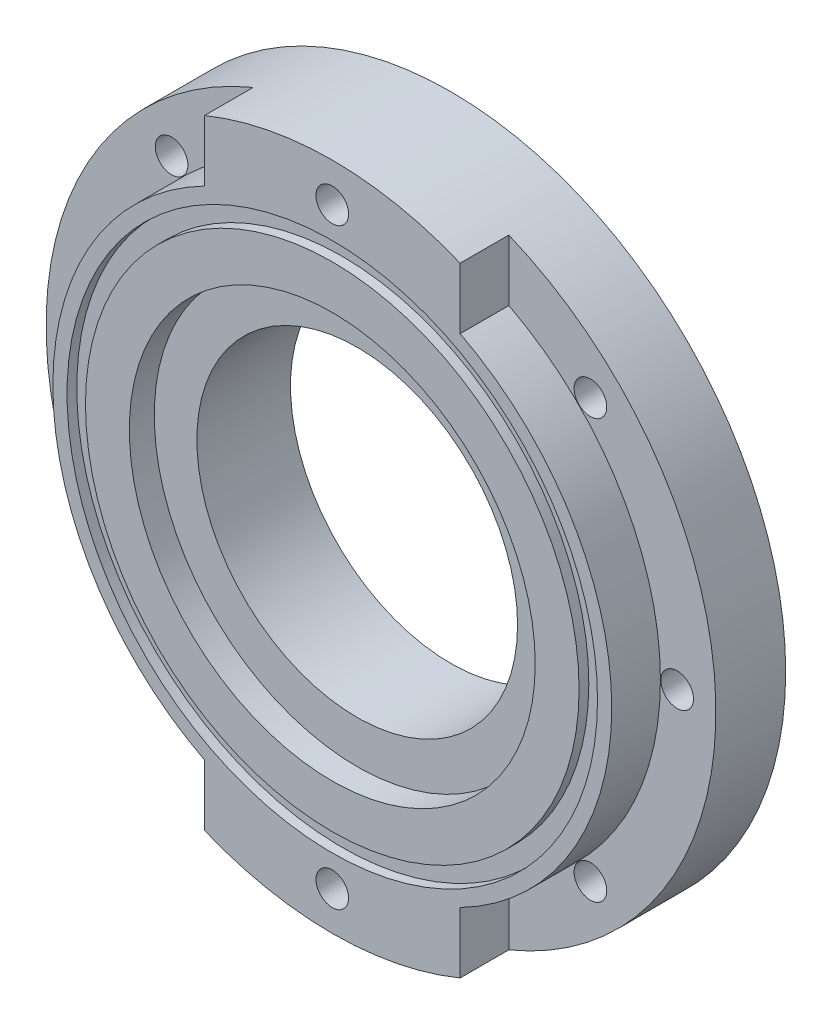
from build123d import *

# Parameters (mm, degrees)
SKETCH1_R           = 52.3875
SKETCH1_R_2         = 25.0825
BOSS_EXTRUDE1_DEPTH = 18.542
SKETCH4_R           = 41.4909
SKETCH4_R_2         = 38.608
CUT_EXTRUDE1_DEPTH  = 1.52146
CIRPATTERN1_COUNT   = 8
SKETCH11_R          = 31.75
CUT_EXTRUDE2_DEPTH  = 3.90144
CUT_EXTRUDE4_START  = -7.62
CUT_EXTRUDE4_DEPTH  = 7.62


with BuildPart() as part:
    # Sketch1 → Boss-Extrude1 (new body)
    with BuildSketch(Plane.XY):
        Circle(SKETCH1_R)
        Circle(SKETCH1_R_2, mode=Mode.SUBTRACT)
    extrude(amount=BOSS_EXTRUDE1_DEPTH)

    # Sketch4 → Cut-Extrude1 (cut)
    with BuildSketch(Plane.XY.offset(18.542)):
        Circle(SKETCH4_R)
        Circle(SKETCH4_R_2, mode=Mode.SUBTRACT)
    extrude(amount=-CUT_EXTRUDE1_DEPTH, mode=Mode.SUBTRACT)

    # Sketch9 → 1_4-20 Tapped Hole1 (revolve, cut)
    with BuildSketch(Plane(origin=(0, 46.330246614, 18.542), x_dir=(0, -1, 0), z_dir=(1, 0, 0))):
        Polygon((0, 0), (0, 15.503816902), (2.5527, 13.97), (2.5527, 0), align=None)
    f_1_4_20_tapped_hole1 = revolve(axis=Axis((0, 46.330246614, 24.892), (0, 0, -1)), mode=Mode.SUBTRACT)

    # CirPattern1: 1_4-20 Tapped Hole1 ×8 about axis
    cirpattern1_axis = Axis((0, 0, 0), (0, 0, 1))
    for i in range(1, CIRPATTERN1_COUNT):
        add(f_1_4_20_tapped_hole1.rotate(cirpattern1_axis, i * 360 / CIRPATTERN1_COUNT), mode=Mode.SUBTRACT)

    # Sketch11 → Cut-Extrude2 (cut)
    with BuildSketch(Plane.XY.offset(18.542)):
        Circle(SKETCH11_R)
    extrude(amount=-CUT_EXTRUDE2_DEPTH, mode=Mode.SUBTRACT)

    # Sketch13 → Cut-Extrude4 (cut)
    with BuildSketch(Plane.XY.offset(18.542).offset(CUT_EXTRUDE4_START)):
        with BuildLine():
            Line((20, 48.41952247), (20, 38.869799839))
            ThreePointArc((20, 38.869799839), (43.7134, 0), (20, -38.869799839))
            Line((20, -38.869799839), (20, -48.41952247))
            ThreePointArc((20, -48.41952247), (52.3875, 0), (20, 48.41952247))
        make_face()
        with BuildLine():
            Line((-20, 48.41952247), (-20, 38.869799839))
            ThreePointArc((-20, 38.869799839), (-43.7134, 0), (-20, -38.869799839))
            Line((-20, -38.869799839), (-20, -48.41952247))
            ThreePointArc((-20, -48.41952247), (-52.3875, 0), (-20, 48.41952247))
        make_face()
    extrude(amount=CUT_EXTRUDE4_DEPTH, mode=Mode.SUBTRACT)


solid = part.part
